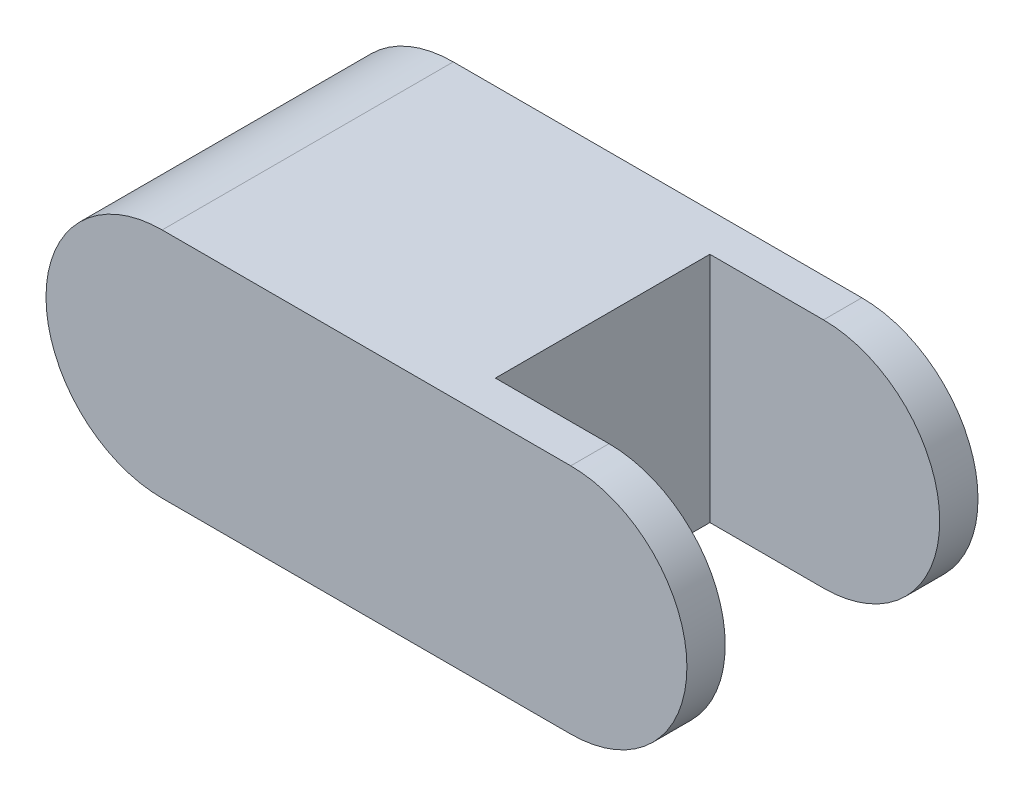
ISO-10303-21;
HEADER;
FILE_DESCRIPTION(('STEP AP214'),'2;1');
FILE_NAME('part.step','',(''),(''),'','','');
FILE_SCHEMA(('AUTOMOTIVE_DESIGN { 1 0 10303 214 1 1 1 1 }'));
ENDSEC;
DATA;
#1=APPLICATION_CONTEXT('core data for automotive mechanical design processes');
#2=APPLICATION_PROTOCOL_DEFINITION('international standard','automotive_design',2000,#1);
#3=PRODUCT_CONTEXT('',#1,'mechanical');
#4=PRODUCT('Part','Part','',(#3));
#5=PRODUCT_RELATED_PRODUCT_CATEGORY('part','',(#4));
#6=PRODUCT_DEFINITION_FORMATION('','',#4);
#7=PRODUCT_DEFINITION_CONTEXT('part definition',#1,'design');
#8=PRODUCT_DEFINITION('design','',#6,#7);
#9=PRODUCT_DEFINITION_SHAPE('','',#8);
#10=(LENGTH_UNIT() NAMED_UNIT(*) SI_UNIT(.MILLI.,.METRE.));
#11=(NAMED_UNIT(*) PLANE_ANGLE_UNIT() SI_UNIT($,.RADIAN.));
#12=(NAMED_UNIT(*) SI_UNIT($,.STERADIAN.) SOLID_ANGLE_UNIT());
#13=UNCERTAINTY_MEASURE_WITH_UNIT(LENGTH_MEASURE(1.E-05),#10,'distance_accuracy_value','');
#14=(GEOMETRIC_REPRESENTATION_CONTEXT(3) GLOBAL_UNCERTAINTY_ASSIGNED_CONTEXT((#13)) GLOBAL_UNIT_ASSIGNED_CONTEXT((#10,
#11,#12)) REPRESENTATION_CONTEXT('',''));
#15=CARTESIAN_POINT('',(0.,0.,0.));
#16=DIRECTION('',(0.,0.,1.));
#17=DIRECTION('',(1.,0.,0.));
#18=AXIS2_PLACEMENT_3D('',#15,#16,#17);
#19=CARTESIAN_POINT('',(160.,0.,-114.));
#20=DIRECTION('',(0.,0.,1.));
#21=DIRECTION('',(1.,0.,0.));
#22=AXIS2_PLACEMENT_3D('',#19,#20,#21);
#23=CYLINDRICAL_SURFACE('',#22,45.5);
#24=CARTESIAN_POINT('',(160.,0.,-99.));
#25=DIRECTION('',(0.,0.,-1.));
#26=DIRECTION('',(-1.,0.,0.));
#27=AXIS2_PLACEMENT_3D('',#24,#25,#26);
#28=CIRCLE('',#27,45.5);
#29=CARTESIAN_POINT('',(160.,-45.5,-99.));
#30=VERTEX_POINT('',#29);
#31=CARTESIAN_POINT('',(160.,45.5,-99.));
#32=VERTEX_POINT('',#31);
#33=EDGE_CURVE('E147',#30,#32,#28,.F.);
#34=ORIENTED_EDGE('',*,*,#33,.F.);
#35=DIRECTION('',(0.,0.,1.));
#36=VECTOR('',#35,1.);
#37=CARTESIAN_POINT('',(160.,-45.5,-114.));
#38=LINE('',#37,#36);
#39=CARTESIAN_POINT('',(160.,-45.5,-114.));
#40=VERTEX_POINT('',#39);
#41=EDGE_CURVE('E125',#40,#30,#38,.T.);
#42=ORIENTED_EDGE('',*,*,#41,.F.);
#43=CARTESIAN_POINT('',(160.,0.,-114.));
#44=DIRECTION('',(0.,0.,1.));
#45=DIRECTION('',(1.,0.,0.));
#46=AXIS2_PLACEMENT_3D('',#43,#44,#45);
#47=CIRCLE('',#46,45.5);
#48=CARTESIAN_POINT('',(160.,45.5,-114.));
#49=VERTEX_POINT('',#48);
#50=EDGE_CURVE('E137',#40,#49,#47,.T.);
#51=ORIENTED_EDGE('',*,*,#50,.T.);
#52=DIRECTION('',(0.,0.,1.));
#53=VECTOR('',#52,1.);
#54=CARTESIAN_POINT('',(160.,45.5,-114.));
#55=LINE('',#54,#53);
#56=EDGE_CURVE('E133',#49,#32,#55,.T.);
#57=ORIENTED_EDGE('',*,*,#56,.T.);
#58=EDGE_LOOP('',(#34,#42,#51,#57));
#59=FACE_BOUND('',#58,.T.);
#60=ADVANCED_FACE('F34',(#59),#23,.T.);
#61=CARTESIAN_POINT('',(0.,0.,-114.));
#62=DIRECTION('',(0.,0.,1.));
#63=DIRECTION('',(1.,0.,0.));
#64=AXIS2_PLACEMENT_3D('',#61,#62,#63);
#65=CYLINDRICAL_SURFACE('',#64,45.5);
#66=CARTESIAN_POINT('',(0.,0.,0.));
#67=DIRECTION('',(0.,0.,1.));
#68=DIRECTION('',(1.,0.,0.));
#69=AXIS2_PLACEMENT_3D('',#66,#67,#68);
#70=CIRCLE('',#69,45.5);
#71=CARTESIAN_POINT('',(0.,45.5,0.));
#72=VERTEX_POINT('',#71);
#73=CARTESIAN_POINT('',(0.,-45.5,0.));
#74=VERTEX_POINT('',#73);
#75=EDGE_CURVE('E143',#72,#74,#70,.T.);
#76=ORIENTED_EDGE('',*,*,#75,.F.);
#77=DIRECTION('',(0.,0.,1.));
#78=VECTOR('',#77,1.);
#79=CARTESIAN_POINT('',(0.,45.5,-114.));
#80=LINE('',#79,#78);
#81=CARTESIAN_POINT('',(0.,45.5,-114.));
#82=VERTEX_POINT('',#81);
#83=EDGE_CURVE('E42',#82,#72,#80,.T.);
#84=ORIENTED_EDGE('',*,*,#83,.F.);
#85=CARTESIAN_POINT('',(0.,0.,-114.));
#86=DIRECTION('',(0.,0.,1.));
#87=DIRECTION('',(1.,0.,0.));
#88=AXIS2_PLACEMENT_3D('',#85,#86,#87);
#89=CIRCLE('',#88,45.5);
#90=CARTESIAN_POINT('',(0.,-45.5,-114.));
#91=VERTEX_POINT('',#90);
#92=EDGE_CURVE('E155',#82,#91,#89,.T.);
#93=ORIENTED_EDGE('',*,*,#92,.T.);
#94=DIRECTION('',(0.,0.,1.));
#95=VECTOR('',#94,1.);
#96=CARTESIAN_POINT('',(0.,-45.5,-114.));
#97=LINE('',#96,#95);
#98=EDGE_CURVE('E83',#91,#74,#97,.T.);
#99=ORIENTED_EDGE('',*,*,#98,.T.);
#100=EDGE_LOOP('',(#76,#84,#93,#99));
#101=FACE_BOUND('',#100,.T.);
#102=ADVANCED_FACE('F36',(#101),#65,.T.);
#103=CARTESIAN_POINT('',(0.,45.5,-114.));
#104=DIRECTION('',(0.,1.,0.));
#105=DIRECTION('',(-1.,0.,0.));
#106=AXIS2_PLACEMENT_3D('',#103,#104,#105);
#107=PLANE('',#106);
#108=DIRECTION('',(-1.,0.,0.));
#109=VECTOR('',#108,1.);
#110=CARTESIAN_POINT('',(205.5,45.5,-99.));
#111=LINE('',#110,#109);
#112=CARTESIAN_POINT('',(115.5,45.5,-99.));
#113=VERTEX_POINT('',#112);
#114=EDGE_CURVE('E120',#32,#113,#111,.T.);
#115=ORIENTED_EDGE('',*,*,#114,.F.);
#116=ORIENTED_EDGE('',*,*,#56,.F.);
#117=DIRECTION('',(-1.,0.,0.));
#118=VECTOR('',#117,1.);
#119=CARTESIAN_POINT('',(0.,45.5,-114.));
#120=LINE('',#119,#118);
#121=EDGE_CURVE('E136',#49,#82,#120,.T.);
#122=ORIENTED_EDGE('',*,*,#121,.T.);
#123=ORIENTED_EDGE('',*,*,#83,.T.);
#124=DIRECTION('',(-1.,0.,0.));
#125=VECTOR('',#124,1.);
#126=CARTESIAN_POINT('',(0.,45.5,0.));
#127=LINE('',#126,#125);
#128=CARTESIAN_POINT('',(160.,45.5,0.));
#129=VERTEX_POINT('',#128);
#130=EDGE_CURVE('E153',#129,#72,#127,.T.);
#131=ORIENTED_EDGE('',*,*,#130,.F.);
#132=CARTESIAN_POINT('',(160.,45.5,-15.));
#133=VERTEX_POINT('',#132);
#134=EDGE_CURVE('E130',#133,#129,#55,.T.);
#135=ORIENTED_EDGE('',*,*,#134,.F.);
#136=DIRECTION('',(1.,0.,0.));
#137=VECTOR('',#136,1.);
#138=CARTESIAN_POINT('',(205.5,45.5,-15.));
#139=LINE('',#138,#137);
#140=CARTESIAN_POINT('',(115.5,45.5,-15.));
#141=VERTEX_POINT('',#140);
#142=EDGE_CURVE('E121',#141,#133,#139,.T.);
#143=ORIENTED_EDGE('',*,*,#142,.F.);
#144=DIRECTION('',(0.,0.,1.));
#145=VECTOR('',#144,1.);
#146=CARTESIAN_POINT('',(115.5,45.5,-99.));
#147=LINE('',#146,#145);
#148=EDGE_CURVE('E159',#113,#141,#147,.T.);
#149=ORIENTED_EDGE('',*,*,#148,.F.);
#150=EDGE_LOOP('',(#115,#116,#122,#123,#131,#135,#143,#149));
#151=FACE_BOUND('',#150,.T.);
#152=ADVANCED_FACE('F157',(#151),#107,.T.);
#153=CARTESIAN_POINT('',(160.,0.,-15.));
#154=DIRECTION('',(0.,0.,1.));
#155=DIRECTION('',(1.,0.,0.));
#156=AXIS2_PLACEMENT_3D('',#153,#154,#155);
#157=CIRCLE('',#156,45.5);
#158=CARTESIAN_POINT('',(160.,-45.5,-15.0000000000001));
#159=VERTEX_POINT('',#158);
#160=EDGE_CURVE('E49',#133,#159,#157,.F.);
#161=ORIENTED_EDGE('',*,*,#160,.F.);
#162=ORIENTED_EDGE('',*,*,#134,.T.);
#163=CARTESIAN_POINT('',(160.,0.,0.));
#164=DIRECTION('',(0.,0.,1.));
#165=DIRECTION('',(1.,0.,0.));
#166=AXIS2_PLACEMENT_3D('',#163,#164,#165);
#167=CIRCLE('',#166,45.5);
#168=CARTESIAN_POINT('',(160.,-45.5,0.));
#169=VERTEX_POINT('',#168);
#170=EDGE_CURVE('E150',#169,#129,#167,.T.);
#171=ORIENTED_EDGE('',*,*,#170,.F.);
#172=EDGE_CURVE('E131',#159,#169,#38,.T.);
#173=ORIENTED_EDGE('',*,*,#172,.F.);
#174=EDGE_LOOP('',(#161,#162,#171,#173));
#175=FACE_BOUND('',#174,.T.);
#176=ADVANCED_FACE('F180',(#175),#23,.T.);
#177=CARTESIAN_POINT('',(0.,-45.5,-114.));
#178=DIRECTION('',(0.,-1.,0.));
#179=DIRECTION('',(1.,0.,0.));
#180=AXIS2_PLACEMENT_3D('',#177,#178,#179);
#181=PLANE('',#180);
#182=DIRECTION('',(1.,0.,0.));
#183=VECTOR('',#182,1.);
#184=CARTESIAN_POINT('',(0.,-45.5,-99.));
#185=LINE('',#184,#183);
#186=CARTESIAN_POINT('',(115.5,-45.5,-99.));
#187=VERTEX_POINT('',#186);
#188=EDGE_CURVE('E11',#187,#30,#185,.T.);
#189=ORIENTED_EDGE('',*,*,#188,.F.);
#190=DIRECTION('',(0.,0.,1.));
#191=VECTOR('',#190,1.);
#192=CARTESIAN_POINT('',(115.5,-45.5,-99.));
#193=LINE('',#192,#191);
#194=CARTESIAN_POINT('',(115.5,-45.5,-15.));
#195=VERTEX_POINT('',#194);
#196=EDGE_CURVE('E107',#187,#195,#193,.T.);
#197=ORIENTED_EDGE('',*,*,#196,.T.);
#198=DIRECTION('',(1.,0.,0.));
#199=VECTOR('',#198,1.);
#200=CARTESIAN_POINT('',(205.5,-45.5,-15.));
#201=LINE('',#200,#199);
#202=EDGE_CURVE('E164',#195,#159,#201,.T.);
#203=ORIENTED_EDGE('',*,*,#202,.T.);
#204=ORIENTED_EDGE('',*,*,#172,.T.);
#205=DIRECTION('',(1.,0.,0.));
#206=VECTOR('',#205,1.);
#207=CARTESIAN_POINT('',(0.,-45.5,0.));
#208=LINE('',#207,#206);
#209=EDGE_CURVE('E146',#74,#169,#208,.T.);
#210=ORIENTED_EDGE('',*,*,#209,.F.);
#211=ORIENTED_EDGE('',*,*,#98,.F.);
#212=DIRECTION('',(1.,0.,0.));
#213=VECTOR('',#212,1.);
#214=CARTESIAN_POINT('',(0.,-45.5,-114.));
#215=LINE('',#214,#213);
#216=EDGE_CURVE('E126',#91,#40,#215,.T.);
#217=ORIENTED_EDGE('',*,*,#216,.T.);
#218=ORIENTED_EDGE('',*,*,#41,.T.);
#219=EDGE_LOOP('',(#189,#197,#203,#204,#210,#211,#217,#218));
#220=FACE_BOUND('',#219,.T.);
#221=ADVANCED_FACE('F124',(#220),#181,.T.);
#222=CARTESIAN_POINT('',(0.,0.,-114.));
#223=DIRECTION('',(0.,0.,1.));
#224=DIRECTION('',(1.,0.,0.));
#225=AXIS2_PLACEMENT_3D('',#222,#223,#224);
#226=PLANE('',#225);
#227=ORIENTED_EDGE('',*,*,#92,.F.);
#228=ORIENTED_EDGE('',*,*,#121,.F.);
#229=ORIENTED_EDGE('',*,*,#50,.F.);
#230=ORIENTED_EDGE('',*,*,#216,.F.);
#231=EDGE_LOOP('',(#227,#228,#229,#230));
#232=FACE_BOUND('',#231,.T.);
#233=ADVANCED_FACE('F170',(#232),#226,.F.);
#234=CARTESIAN_POINT('',(0.,0.,0.));
#235=DIRECTION('',(0.,0.,1.));
#236=DIRECTION('',(1.,0.,0.));
#237=AXIS2_PLACEMENT_3D('',#234,#235,#236);
#238=PLANE('',#237);
#239=ORIENTED_EDGE('',*,*,#75,.T.);
#240=ORIENTED_EDGE('',*,*,#209,.T.);
#241=ORIENTED_EDGE('',*,*,#170,.T.);
#242=ORIENTED_EDGE('',*,*,#130,.T.);
#243=EDGE_LOOP('',(#239,#240,#241,#242));
#244=FACE_BOUND('',#243,.T.);
#245=ADVANCED_FACE('F172',(#244),#238,.T.);
#246=CARTESIAN_POINT('',(205.5,-168.609707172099,-99.));
#247=DIRECTION('',(0.,0.,-1.));
#248=DIRECTION('',(-1.,0.,0.));
#249=AXIS2_PLACEMENT_3D('',#246,#247,#248);
#250=PLANE('',#249);
#251=ORIENTED_EDGE('',*,*,#33,.T.);
#252=ORIENTED_EDGE('',*,*,#114,.T.);
#253=DIRECTION('',(0.,1.,0.));
#254=VECTOR('',#253,1.);
#255=CARTESIAN_POINT('',(115.5,-168.609707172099,-99.));
#256=LINE('',#255,#254);
#257=EDGE_CURVE('E111',#187,#113,#256,.T.);
#258=ORIENTED_EDGE('',*,*,#257,.F.);
#259=ORIENTED_EDGE('',*,*,#188,.T.);
#260=EDGE_LOOP('',(#251,#252,#258,#259));
#261=FACE_BOUND('',#260,.T.);
#262=ADVANCED_FACE('F117',(#261),#250,.F.);
#263=CARTESIAN_POINT('',(115.5,-168.609707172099,-99.));
#264=DIRECTION('',(-1.,0.,0.));
#265=DIRECTION('',(0.,-1.,0.));
#266=AXIS2_PLACEMENT_3D('',#263,#264,#265);
#267=PLANE('',#266);
#268=ORIENTED_EDGE('',*,*,#257,.T.);
#269=ORIENTED_EDGE('',*,*,#148,.T.);
#270=DIRECTION('',(0.,1.,0.));
#271=VECTOR('',#270,1.);
#272=CARTESIAN_POINT('',(115.5,-168.609707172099,-15.));
#273=LINE('',#272,#271);
#274=EDGE_CURVE('E113',#195,#141,#273,.T.);
#275=ORIENTED_EDGE('',*,*,#274,.F.);
#276=ORIENTED_EDGE('',*,*,#196,.F.);
#277=EDGE_LOOP('',(#268,#269,#275,#276));
#278=FACE_BOUND('',#277,.T.);
#279=ADVANCED_FACE('F109',(#278),#267,.F.);
#280=CARTESIAN_POINT('',(205.5,-168.609707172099,-15.));
#281=DIRECTION('',(0.,0.,1.));
#282=DIRECTION('',(1.,0.,0.));
#283=AXIS2_PLACEMENT_3D('',#280,#281,#282);
#284=PLANE('',#283);
#285=ORIENTED_EDGE('',*,*,#160,.T.);
#286=ORIENTED_EDGE('',*,*,#202,.F.);
#287=ORIENTED_EDGE('',*,*,#274,.T.);
#288=ORIENTED_EDGE('',*,*,#142,.T.);
#289=EDGE_LOOP('',(#285,#286,#287,#288));
#290=FACE_BOUND('',#289,.T.);
#291=ADVANCED_FACE('F196',(#290),#284,.F.);
#292=CLOSED_SHELL('',(#60,#102,#152,#176,#221,#233,#245,#262,#279,#291));
#293=MANIFOLD_SOLID_BREP('B2',#292);
#294=ADVANCED_BREP_SHAPE_REPRESENTATION('',(#18,#293),#14);
#295=SHAPE_DEFINITION_REPRESENTATION(#9,#294);
ENDSEC;
END-ISO-10303-21;
